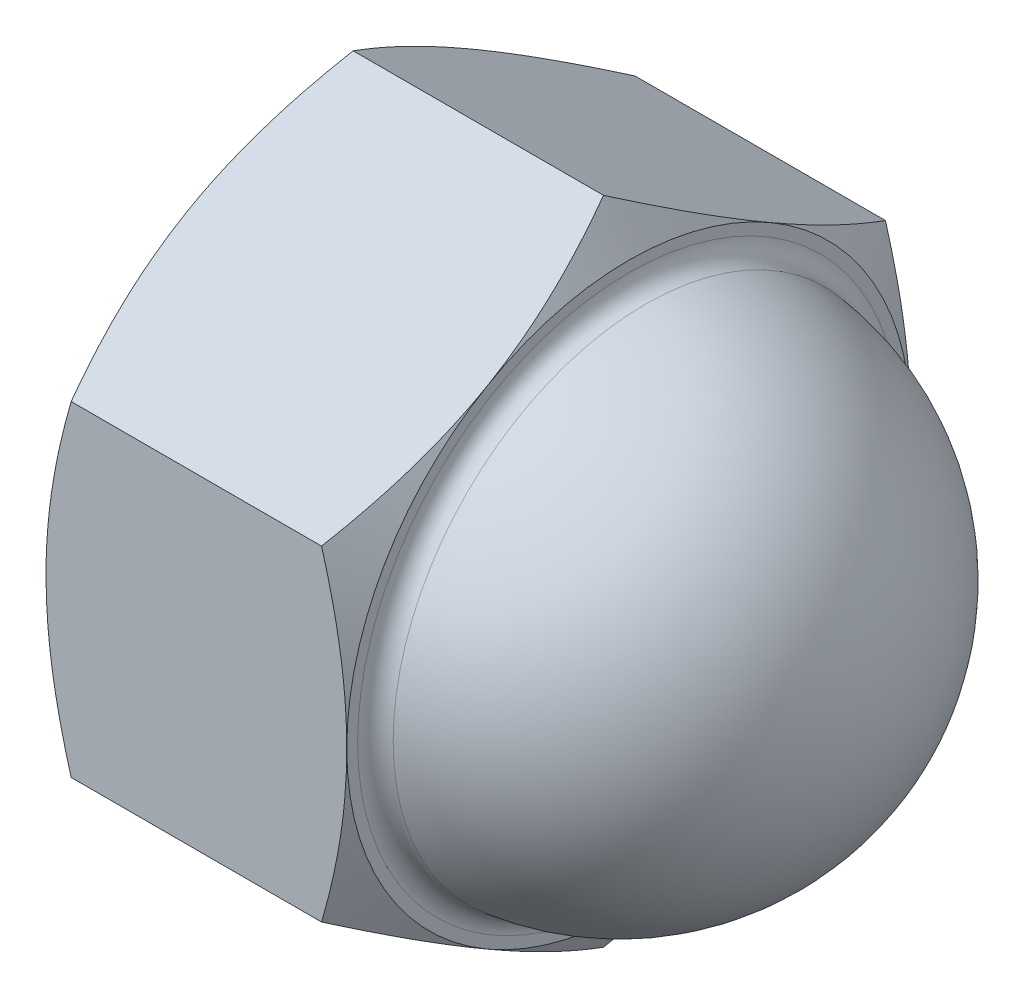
from build123d import *

# Parameters (mm, degrees)
BASENUT_DEPTH = 16
DOMEFILLET_R  = 1


with BuildPart() as part:
    # BaseNutSke → BaseNut (new body)
    with BuildSketch(Plane(origin=(0, 0, 0), x_dir=(0, 0, -1), z_dir=(1, 0, 0))):
        Polygon((15, 8.660254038), (15, -8.660254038), (0, -17.320508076), (-15, -8.660254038), (-15, 8.660254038), (0, 17.320508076), align=None)
    extrude(amount=BASENUT_DEPTH)

    # DomeSke → Dome (revolve)
    with BuildSketch(Plane.XY):
        with BuildLine():
            Line((29, 0), (27.4, 0))
            ThreePointArc((27.4, 0), (23.914570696, 8.414570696), (15.5, 11.9))
            Line((15.5, 11.9), (0, 11.9))
            Line((0, 11.9), (0, 13.5))
            Line((0, 13.5), (15.5, 13.5))
            ThreePointArc((15.5, 13.5), (25.045941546, 9.545941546), (29, 0))
        make_face()
    revolve(axis=Axis((0, 0, 0), (1, 0, 0)))

    # Sketch4 → DoubleChamfer (revolve, cut)
    with BuildSketch(Plane.XY):
        Polygon((0, 15), (2.783121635, 19.820508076), (13.216878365, 19.820508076), (16, 15), (18, 15), (18, 30), (-2, 30), (-2, 15), align=None)
    revolve(axis=Axis((0, 0, 0), (1, 0, 0)), mode=Mode.SUBTRACT)

    # TapDriSke → TapDrill (revolve, cut)
    with BuildSketch(Plane.XY, mode=Mode.PRIVATE) as tapdrill_sk:
        Polygon((0, 8.75), (21.4, 8.75), (26.657530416, 0), (0, 0), align=None)
    revolve(tapdrill_sk.sketch.rotate(Axis((0, 0, 0), (1, 0, 0)), 90), axis=Axis((0, 0, 0), (1, 0, 0)), mode=Mode.SUBTRACT)

    # EndChamferSketch → EndChamfer (revolve, cut)
    with BuildSketch(Plane.XY, mode=Mode.PRIVATE) as endchamfer_sk:
        Polygon((-0.0746, 10), (0.0254, 10), (0.988185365, 8.625), (-0.0746, 8.625), align=None)
        Polygon((15.9746, 10), (16.1, 10), (16.1, 8.625), (15.011814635, 8.625), align=None)
    revolve(endchamfer_sk.sketch.rotate(Axis((0, 0, 0), (-1, 0, 0)), 90), axis=Axis((0, 0, 0), (-1, 0, 0)), mode=Mode.SUBTRACT)

    # DomeFillet
    domefillet_edges = [part.edges().sort_by_distance(p)[0] for p in [
        (16, -13.490737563, 0),
    ]]
    fillet(domefillet_edges, radius=DOMEFILLET_R)


solid = part.part
